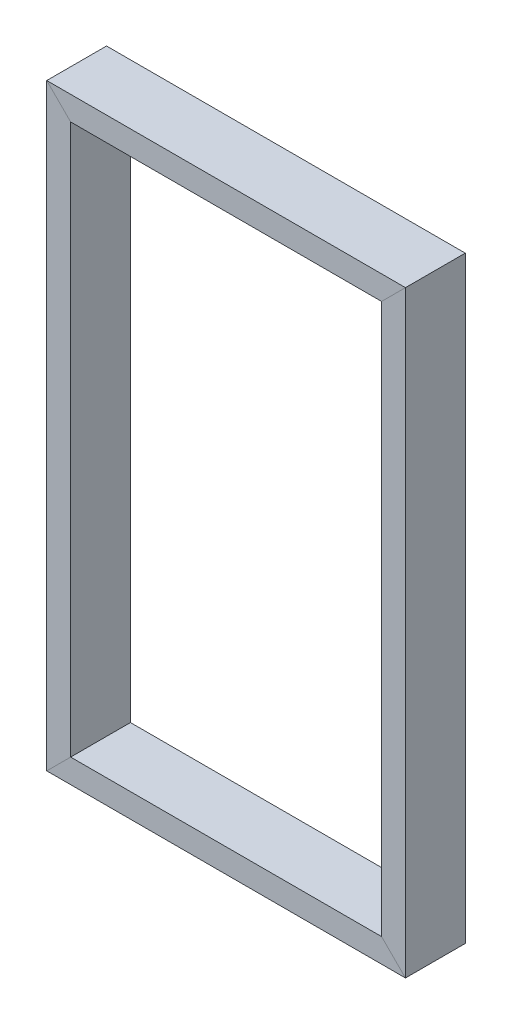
ISO-10303-21;
HEADER;
FILE_DESCRIPTION(('STEP AP214'),'2;1');
FILE_NAME('part.step','',(''),(''),'','','');
FILE_SCHEMA(('AUTOMOTIVE_DESIGN { 1 0 10303 214 1 1 1 1 }'));
ENDSEC;
DATA;
#1=APPLICATION_CONTEXT('core data for automotive mechanical design processes');
#2=APPLICATION_PROTOCOL_DEFINITION('international standard','automotive_design',2000,#1);
#3=PRODUCT_CONTEXT('',#1,'mechanical');
#4=PRODUCT('Part','Part','',(#3));
#5=PRODUCT_RELATED_PRODUCT_CATEGORY('part','',(#4));
#6=PRODUCT_DEFINITION_FORMATION('','',#4);
#7=PRODUCT_DEFINITION_CONTEXT('part definition',#1,'design');
#8=PRODUCT_DEFINITION('design','',#6,#7);
#9=PRODUCT_DEFINITION_SHAPE('','',#8);
#10=(LENGTH_UNIT() NAMED_UNIT(*) SI_UNIT(.MILLI.,.METRE.));
#11=(NAMED_UNIT(*) PLANE_ANGLE_UNIT() SI_UNIT($,.RADIAN.));
#12=(NAMED_UNIT(*) SI_UNIT($,.STERADIAN.) SOLID_ANGLE_UNIT());
#13=UNCERTAINTY_MEASURE_WITH_UNIT(LENGTH_MEASURE(1.E-05),#10,'distance_accuracy_value','');
#14=(GEOMETRIC_REPRESENTATION_CONTEXT(3) GLOBAL_UNCERTAINTY_ASSIGNED_CONTEXT((#13)) GLOBAL_UNIT_ASSIGNED_CONTEXT((#10,
#11,#12)) REPRESENTATION_CONTEXT('',''));
#15=CARTESIAN_POINT('',(0.,0.,0.));
#16=DIRECTION('',(0.,0.,1.));
#17=DIRECTION('',(1.,0.,0.));
#18=AXIS2_PLACEMENT_3D('',#15,#16,#17);
#19=CARTESIAN_POINT('',(150.000000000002,-249.999999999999,25.));
#20=DIRECTION('',(-1.,0.,0.));
#21=DIRECTION('',(0.,-1.,0.));
#22=AXIS2_PLACEMENT_3D('',#19,#20,#21);
#23=PLANE('',#22);
#24=DIRECTION('',(0.,1.,0.));
#25=VECTOR('',#24,1.);
#26=CARTESIAN_POINT('',(150.000000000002,-249.999999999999,-25.));
#27=LINE('',#26,#25);
#28=CARTESIAN_POINT('',(150.000000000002,-249.999999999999,-25.));
#29=VERTEX_POINT('',#28);
#30=CARTESIAN_POINT('',(149.999999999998,250.000000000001,-25.));
#31=VERTEX_POINT('',#30);
#32=EDGE_CURVE('E88',#29,#31,#27,.T.);
#33=ORIENTED_EDGE('',*,*,#32,.T.);
#34=DIRECTION('',(0.,0.,-1.));
#35=VECTOR('',#34,1.);
#36=CARTESIAN_POINT('',(149.999999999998,250.000000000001,25.));
#37=LINE('',#36,#35);
#38=CARTESIAN_POINT('',(149.999999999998,250.000000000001,25.));
#39=VERTEX_POINT('',#38);
#40=EDGE_CURVE('E12',#39,#31,#37,.T.);
#41=ORIENTED_EDGE('',*,*,#40,.F.);
#42=DIRECTION('',(0.,1.,0.));
#43=VECTOR('',#42,1.);
#44=CARTESIAN_POINT('',(150.000000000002,-249.999999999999,25.));
#45=LINE('',#44,#43);
#46=CARTESIAN_POINT('',(150.000000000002,-249.999999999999,25.));
#47=VERTEX_POINT('',#46);
#48=EDGE_CURVE('E106',#47,#39,#45,.T.);
#49=ORIENTED_EDGE('',*,*,#48,.F.);
#50=DIRECTION('',(0.,0.,-1.));
#51=VECTOR('',#50,1.);
#52=CARTESIAN_POINT('',(150.000000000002,-249.999999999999,25.));
#53=LINE('',#52,#51);
#54=EDGE_CURVE('E100',#47,#29,#53,.T.);
#55=ORIENTED_EDGE('',*,*,#54,.T.);
#56=EDGE_LOOP('',(#33,#41,#49,#55));
#57=FACE_BOUND('',#56,.T.);
#58=ADVANCED_FACE('F44',(#57),#23,.F.);
#59=CARTESIAN_POINT('',(149.999999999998,250.000000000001,25.));
#60=DIRECTION('',(0.707106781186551,-0.707106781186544,0.));
#61=DIRECTION('',(0.707106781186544,0.707106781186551,0.));
#62=AXIS2_PLACEMENT_3D('',#59,#60,#61);
#63=PLANE('',#62);
#64=DIRECTION('',(-0.707106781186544,-0.707106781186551,0.));
#65=VECTOR('',#64,1.);
#66=CARTESIAN_POINT('',(149.999999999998,250.000000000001,-25.));
#67=LINE('',#66,#65);
#68=CARTESIAN_POINT('',(129.999999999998,230.000000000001,-25.));
#69=VERTEX_POINT('',#68);
#70=EDGE_CURVE('E84',#31,#69,#67,.T.);
#71=ORIENTED_EDGE('',*,*,#70,.T.);
#72=DIRECTION('',(0.,0.,-1.));
#73=VECTOR('',#72,1.);
#74=CARTESIAN_POINT('',(129.999999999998,230.000000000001,25.));
#75=LINE('',#74,#73);
#76=CARTESIAN_POINT('',(129.999999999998,230.000000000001,25.));
#77=VERTEX_POINT('',#76);
#78=EDGE_CURVE('E51',#77,#69,#75,.T.);
#79=ORIENTED_EDGE('',*,*,#78,.F.);
#80=DIRECTION('',(-0.707106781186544,-0.707106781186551,0.));
#81=VECTOR('',#80,1.);
#82=CARTESIAN_POINT('',(149.999999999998,250.000000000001,25.));
#83=LINE('',#82,#81);
#84=EDGE_CURVE('E96',#39,#77,#83,.T.);
#85=ORIENTED_EDGE('',*,*,#84,.F.);
#86=ORIENTED_EDGE('',*,*,#40,.T.);
#87=EDGE_LOOP('',(#71,#79,#85,#86));
#88=FACE_BOUND('',#87,.T.);
#89=ADVANCED_FACE('F95',(#88),#63,.F.);
#90=CARTESIAN_POINT('',(130.000000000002,-229.999999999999,25.));
#91=DIRECTION('',(1.,0.,0.));
#92=DIRECTION('',(0.,1.,0.));
#93=AXIS2_PLACEMENT_3D('',#90,#91,#92);
#94=PLANE('',#93);
#95=DIRECTION('',(0.,-1.,0.));
#96=VECTOR('',#95,1.);
#97=CARTESIAN_POINT('',(130.000000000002,-229.999999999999,-25.));
#98=LINE('',#97,#96);
#99=CARTESIAN_POINT('',(130.000000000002,-229.999999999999,-25.));
#100=VERTEX_POINT('',#99);
#101=EDGE_CURVE('E89',#69,#100,#98,.T.);
#102=ORIENTED_EDGE('',*,*,#101,.T.);
#103=DIRECTION('',(0.,0.,-1.));
#104=VECTOR('',#103,1.);
#105=CARTESIAN_POINT('',(130.000000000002,-229.999999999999,25.));
#106=LINE('',#105,#104);
#107=CARTESIAN_POINT('',(130.000000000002,-229.999999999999,25.));
#108=VERTEX_POINT('',#107);
#109=EDGE_CURVE('E112',#108,#100,#106,.T.);
#110=ORIENTED_EDGE('',*,*,#109,.F.);
#111=DIRECTION('',(0.,-1.,0.));
#112=VECTOR('',#111,1.);
#113=CARTESIAN_POINT('',(130.000000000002,-229.999999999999,25.));
#114=LINE('',#113,#112);
#115=EDGE_CURVE('E63',#77,#108,#114,.T.);
#116=ORIENTED_EDGE('',*,*,#115,.F.);
#117=ORIENTED_EDGE('',*,*,#78,.T.);
#118=EDGE_LOOP('',(#102,#110,#116,#117));
#119=FACE_BOUND('',#118,.T.);
#120=ADVANCED_FACE('F115',(#119),#94,.F.);
#121=CARTESIAN_POINT('',(150.000000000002,-249.999999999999,25.));
#122=DIRECTION('',(0.707106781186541,0.707106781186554,0.));
#123=DIRECTION('',(-0.707106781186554,0.707106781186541,0.));
#124=AXIS2_PLACEMENT_3D('',#121,#122,#123);
#125=PLANE('',#124);
#126=DIRECTION('',(0.707106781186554,-0.707106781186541,0.));
#127=VECTOR('',#126,1.);
#128=CARTESIAN_POINT('',(150.000000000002,-249.999999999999,-25.));
#129=LINE('',#128,#127);
#130=EDGE_CURVE('E104',#100,#29,#129,.T.);
#131=ORIENTED_EDGE('',*,*,#130,.T.);
#132=ORIENTED_EDGE('',*,*,#54,.F.);
#133=DIRECTION('',(0.707106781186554,-0.707106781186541,0.));
#134=VECTOR('',#133,1.);
#135=CARTESIAN_POINT('',(150.000000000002,-249.999999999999,25.));
#136=LINE('',#135,#134);
#137=EDGE_CURVE('E58',#108,#47,#136,.T.);
#138=ORIENTED_EDGE('',*,*,#137,.F.);
#139=ORIENTED_EDGE('',*,*,#109,.T.);
#140=EDGE_LOOP('',(#131,#132,#138,#139));
#141=FACE_BOUND('',#140,.T.);
#142=ADVANCED_FACE('F117',(#141),#125,.F.);
#143=CARTESIAN_POINT('',(149.999999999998,250.000000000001,25.));
#144=DIRECTION('',(0.,0.,1.));
#145=DIRECTION('',(-1.,0.,0.));
#146=AXIS2_PLACEMENT_3D('',#143,#144,#145);
#147=PLANE('',#146);
#148=ORIENTED_EDGE('',*,*,#48,.T.);
#149=ORIENTED_EDGE('',*,*,#84,.T.);
#150=ORIENTED_EDGE('',*,*,#115,.T.);
#151=ORIENTED_EDGE('',*,*,#137,.T.);
#152=EDGE_LOOP('',(#148,#149,#150,#151));
#153=FACE_BOUND('',#152,.T.);
#154=ADVANCED_FACE('F118',(#153),#147,.T.);
#155=CARTESIAN_POINT('',(149.999999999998,250.000000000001,-25.));
#156=DIRECTION('',(0.,0.,1.));
#157=DIRECTION('',(-1.,0.,0.));
#158=AXIS2_PLACEMENT_3D('',#155,#156,#157);
#159=PLANE('',#158);
#160=ORIENTED_EDGE('',*,*,#32,.F.);
#161=ORIENTED_EDGE('',*,*,#130,.F.);
#162=ORIENTED_EDGE('',*,*,#101,.F.);
#163=ORIENTED_EDGE('',*,*,#70,.F.);
#164=EDGE_LOOP('',(#160,#161,#162,#163));
#165=FACE_BOUND('',#164,.T.);
#166=ADVANCED_FACE('F85',(#165),#159,.F.);
#167=CLOSED_SHELL('',(#58,#89,#120,#142,#154,#166));
#168=MANIFOLD_SOLID_BREP('B2',#167);
#169=CARTESIAN_POINT('',(130.000000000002,-229.999999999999,25.));
#170=DIRECTION('',(0.,-1.,0.));
#171=DIRECTION('',(0.,0.,1.));
#172=AXIS2_PLACEMENT_3D('',#169,#170,#171);
#173=PLANE('',#172);
#174=DIRECTION('',(-1.,0.,0.));
#175=VECTOR('',#174,1.);
#176=CARTESIAN_POINT('',(130.000000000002,-229.999999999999,-25.));
#177=LINE('',#176,#175);
#178=CARTESIAN_POINT('',(130.000000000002,-229.999999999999,-25.));
#179=VERTEX_POINT('',#178);
#180=CARTESIAN_POINT('',(-129.999999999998,-230.000000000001,-25.));
#181=VERTEX_POINT('',#180);
#182=EDGE_CURVE('E222',#179,#181,#177,.T.);
#183=ORIENTED_EDGE('',*,*,#182,.T.);
#184=DIRECTION('',(0.,0.,-1.));
#185=VECTOR('',#184,1.);
#186=CARTESIAN_POINT('',(-129.999999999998,-230.000000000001,25.));
#187=LINE('',#186,#185);
#188=CARTESIAN_POINT('',(-129.999999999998,-230.000000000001,25.));
#189=VERTEX_POINT('',#188);
#190=EDGE_CURVE('E42',#189,#181,#187,.T.);
#191=ORIENTED_EDGE('',*,*,#190,.F.);
#192=DIRECTION('',(-1.,0.,0.));
#193=VECTOR('',#192,1.);
#194=CARTESIAN_POINT('',(130.000000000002,-229.999999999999,25.));
#195=LINE('',#194,#193);
#196=CARTESIAN_POINT('',(130.000000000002,-229.999999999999,25.));
#197=VERTEX_POINT('',#196);
#198=EDGE_CURVE('E240',#197,#189,#195,.T.);
#199=ORIENTED_EDGE('',*,*,#198,.F.);
#200=DIRECTION('',(0.,0.,-1.));
#201=VECTOR('',#200,1.);
#202=CARTESIAN_POINT('',(130.000000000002,-229.999999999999,25.));
#203=LINE('',#202,#201);
#204=EDGE_CURVE('E234',#197,#179,#203,.T.);
#205=ORIENTED_EDGE('',*,*,#204,.T.);
#206=EDGE_LOOP('',(#183,#191,#199,#205));
#207=FACE_BOUND('',#206,.T.);
#208=ADVANCED_FACE('F178',(#207),#173,.F.);
#209=CARTESIAN_POINT('',(-129.999999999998,-230.000000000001,25.));
#210=DIRECTION('',(0.707106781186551,-0.707106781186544,0.));
#211=DIRECTION('',(0.707106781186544,0.707106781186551,0.));
#212=AXIS2_PLACEMENT_3D('',#209,#210,#211);
#213=PLANE('',#212);
#214=DIRECTION('',(-0.707106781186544,-0.707106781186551,0.));
#215=VECTOR('',#214,1.);
#216=CARTESIAN_POINT('',(-129.999999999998,-230.000000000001,-25.));
#217=LINE('',#216,#215);
#218=CARTESIAN_POINT('',(-149.999999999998,-250.000000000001,-25.));
#219=VERTEX_POINT('',#218);
#220=EDGE_CURVE('E218',#181,#219,#217,.T.);
#221=ORIENTED_EDGE('',*,*,#220,.T.);
#222=DIRECTION('',(0.,0.,-1.));
#223=VECTOR('',#222,1.);
#224=CARTESIAN_POINT('',(-149.999999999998,-250.000000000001,25.));
#225=LINE('',#224,#223);
#226=CARTESIAN_POINT('',(-149.999999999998,-250.000000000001,25.));
#227=VERTEX_POINT('',#226);
#228=EDGE_CURVE('E185',#227,#219,#225,.T.);
#229=ORIENTED_EDGE('',*,*,#228,.F.);
#230=DIRECTION('',(-0.707106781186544,-0.707106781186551,0.));
#231=VECTOR('',#230,1.);
#232=CARTESIAN_POINT('',(-129.999999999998,-230.000000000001,25.));
#233=LINE('',#232,#231);
#234=EDGE_CURVE('E230',#189,#227,#233,.T.);
#235=ORIENTED_EDGE('',*,*,#234,.F.);
#236=ORIENTED_EDGE('',*,*,#190,.T.);
#237=EDGE_LOOP('',(#221,#229,#235,#236));
#238=FACE_BOUND('',#237,.T.);
#239=ADVANCED_FACE('F229',(#238),#213,.F.);
#240=CARTESIAN_POINT('',(150.000000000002,-249.999999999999,25.));
#241=DIRECTION('',(0.,1.,0.));
#242=DIRECTION('',(0.,0.,-1.));
#243=AXIS2_PLACEMENT_3D('',#240,#241,#242);
#244=PLANE('',#243);
#245=DIRECTION('',(1.,0.,0.));
#246=VECTOR('',#245,1.);
#247=CARTESIAN_POINT('',(150.000000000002,-249.999999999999,-25.));
#248=LINE('',#247,#246);
#249=CARTESIAN_POINT('',(150.000000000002,-249.999999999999,-25.));
#250=VERTEX_POINT('',#249);
#251=EDGE_CURVE('E223',#219,#250,#248,.T.);
#252=ORIENTED_EDGE('',*,*,#251,.T.);
#253=DIRECTION('',(0.,0.,-1.));
#254=VECTOR('',#253,1.);
#255=CARTESIAN_POINT('',(150.000000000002,-249.999999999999,25.));
#256=LINE('',#255,#254);
#257=CARTESIAN_POINT('',(150.000000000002,-249.999999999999,25.));
#258=VERTEX_POINT('',#257);
#259=EDGE_CURVE('E246',#258,#250,#256,.T.);
#260=ORIENTED_EDGE('',*,*,#259,.F.);
#261=DIRECTION('',(1.,0.,0.));
#262=VECTOR('',#261,1.);
#263=CARTESIAN_POINT('',(150.000000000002,-249.999999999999,25.));
#264=LINE('',#263,#262);
#265=EDGE_CURVE('E197',#227,#258,#264,.T.);
#266=ORIENTED_EDGE('',*,*,#265,.F.);
#267=ORIENTED_EDGE('',*,*,#228,.T.);
#268=EDGE_LOOP('',(#252,#260,#266,#267));
#269=FACE_BOUND('',#268,.T.);
#270=ADVANCED_FACE('F249',(#269),#244,.F.);
#271=CARTESIAN_POINT('',(130.000000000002,-229.999999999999,25.));
#272=DIRECTION('',(-0.707106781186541,-0.707106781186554,0.));
#273=DIRECTION('',(0.707106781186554,-0.707106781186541,0.));
#274=AXIS2_PLACEMENT_3D('',#271,#272,#273);
#275=PLANE('',#274);
#276=DIRECTION('',(-0.707106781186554,0.707106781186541,0.));
#277=VECTOR('',#276,1.);
#278=CARTESIAN_POINT('',(130.000000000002,-229.999999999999,-25.));
#279=LINE('',#278,#277);
#280=EDGE_CURVE('E238',#250,#179,#279,.T.);
#281=ORIENTED_EDGE('',*,*,#280,.T.);
#282=ORIENTED_EDGE('',*,*,#204,.F.);
#283=DIRECTION('',(-0.707106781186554,0.707106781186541,0.));
#284=VECTOR('',#283,1.);
#285=CARTESIAN_POINT('',(130.000000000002,-229.999999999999,25.));
#286=LINE('',#285,#284);
#287=EDGE_CURVE('E192',#258,#197,#286,.T.);
#288=ORIENTED_EDGE('',*,*,#287,.F.);
#289=ORIENTED_EDGE('',*,*,#259,.T.);
#290=EDGE_LOOP('',(#281,#282,#288,#289));
#291=FACE_BOUND('',#290,.T.);
#292=ADVANCED_FACE('F251',(#291),#275,.F.);
#293=CARTESIAN_POINT('',(-129.999999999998,-230.000000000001,25.));
#294=DIRECTION('',(0.,0.,1.));
#295=DIRECTION('',(-1.,0.,0.));
#296=AXIS2_PLACEMENT_3D('',#293,#294,#295);
#297=PLANE('',#296);
#298=ORIENTED_EDGE('',*,*,#198,.T.);
#299=ORIENTED_EDGE('',*,*,#234,.T.);
#300=ORIENTED_EDGE('',*,*,#265,.T.);
#301=ORIENTED_EDGE('',*,*,#287,.T.);
#302=EDGE_LOOP('',(#298,#299,#300,#301));
#303=FACE_BOUND('',#302,.T.);
#304=ADVANCED_FACE('F252',(#303),#297,.T.);
#305=CARTESIAN_POINT('',(-129.999999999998,-230.000000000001,-25.));
#306=DIRECTION('',(0.,0.,1.));
#307=DIRECTION('',(-1.,0.,0.));
#308=AXIS2_PLACEMENT_3D('',#305,#306,#307);
#309=PLANE('',#308);
#310=ORIENTED_EDGE('',*,*,#182,.F.);
#311=ORIENTED_EDGE('',*,*,#280,.F.);
#312=ORIENTED_EDGE('',*,*,#251,.F.);
#313=ORIENTED_EDGE('',*,*,#220,.F.);
#314=EDGE_LOOP('',(#310,#311,#312,#313));
#315=FACE_BOUND('',#314,.T.);
#316=ADVANCED_FACE('F219',(#315),#309,.F.);
#317=CLOSED_SHELL('',(#208,#239,#270,#292,#304,#316));
#318=MANIFOLD_SOLID_BREP('B6',#317);
#319=CARTESIAN_POINT('',(-130.,230.,25.));
#320=DIRECTION('',(0.,1.,0.));
#321=DIRECTION('',(0.,0.,1.));
#322=AXIS2_PLACEMENT_3D('',#319,#320,#321);
#323=PLANE('',#322);
#324=DIRECTION('',(1.,0.,0.));
#325=VECTOR('',#324,1.);
#326=CARTESIAN_POINT('',(-130.,230.,-25.));
#327=LINE('',#326,#325);
#328=CARTESIAN_POINT('',(-130.,230.,-25.));
#329=VERTEX_POINT('',#328);
#330=CARTESIAN_POINT('',(130.,230.,-25.));
#331=VERTEX_POINT('',#330);
#332=EDGE_CURVE('E355',#329,#331,#327,.T.);
#333=ORIENTED_EDGE('',*,*,#332,.T.);
#334=DIRECTION('',(0.,0.,-1.));
#335=VECTOR('',#334,1.);
#336=CARTESIAN_POINT('',(130.,230.,25.));
#337=LINE('',#336,#335);
#338=CARTESIAN_POINT('',(130.,230.,25.));
#339=VERTEX_POINT('',#338);
#340=EDGE_CURVE('E176',#339,#331,#337,.T.);
#341=ORIENTED_EDGE('',*,*,#340,.F.);
#342=DIRECTION('',(1.,0.,0.));
#343=VECTOR('',#342,1.);
#344=CARTESIAN_POINT('',(-130.,230.,25.));
#345=LINE('',#344,#343);
#346=CARTESIAN_POINT('',(-130.,230.,25.));
#347=VERTEX_POINT('',#346);
#348=EDGE_CURVE('E373',#347,#339,#345,.T.);
#349=ORIENTED_EDGE('',*,*,#348,.F.);
#350=DIRECTION('',(0.,0.,-1.));
#351=VECTOR('',#350,1.);
#352=CARTESIAN_POINT('',(-130.,230.,25.));
#353=LINE('',#352,#351);
#354=EDGE_CURVE('E367',#347,#329,#353,.T.);
#355=ORIENTED_EDGE('',*,*,#354,.T.);
#356=EDGE_LOOP('',(#333,#341,#349,#355));
#357=FACE_BOUND('',#356,.T.);
#358=ADVANCED_FACE('F311',(#357),#323,.F.);
#359=CARTESIAN_POINT('',(130.,230.,25.));
#360=DIRECTION('',(-0.707106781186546,0.707106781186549,0.));
#361=DIRECTION('',(-0.707106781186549,-0.707106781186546,0.));
#362=AXIS2_PLACEMENT_3D('',#359,#360,#361);
#363=PLANE('',#362);
#364=DIRECTION('',(0.707106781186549,0.707106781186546,0.));
#365=VECTOR('',#364,1.);
#366=CARTESIAN_POINT('',(130.,230.,-25.));
#367=LINE('',#366,#365);
#368=CARTESIAN_POINT('',(150.,250.,-25.));
#369=VERTEX_POINT('',#368);
#370=EDGE_CURVE('E351',#331,#369,#367,.T.);
#371=ORIENTED_EDGE('',*,*,#370,.T.);
#372=DIRECTION('',(0.,0.,-1.));
#373=VECTOR('',#372,1.);
#374=CARTESIAN_POINT('',(150.,250.,25.));
#375=LINE('',#374,#373);
#376=CARTESIAN_POINT('',(150.,250.,25.));
#377=VERTEX_POINT('',#376);
#378=EDGE_CURVE('E318',#377,#369,#375,.T.);
#379=ORIENTED_EDGE('',*,*,#378,.F.);
#380=DIRECTION('',(0.707106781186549,0.707106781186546,0.));
#381=VECTOR('',#380,1.);
#382=CARTESIAN_POINT('',(130.,230.,25.));
#383=LINE('',#382,#381);
#384=EDGE_CURVE('E363',#339,#377,#383,.T.);
#385=ORIENTED_EDGE('',*,*,#384,.F.);
#386=ORIENTED_EDGE('',*,*,#340,.T.);
#387=EDGE_LOOP('',(#371,#379,#385,#386));
#388=FACE_BOUND('',#387,.T.);
#389=ADVANCED_FACE('F362',(#388),#363,.F.);
#390=CARTESIAN_POINT('',(-150.,250.,25.));
#391=DIRECTION('',(0.,-1.,0.));
#392=DIRECTION('',(0.,0.,-1.));
#393=AXIS2_PLACEMENT_3D('',#390,#391,#392);
#394=PLANE('',#393);
#395=DIRECTION('',(-1.,0.,0.));
#396=VECTOR('',#395,1.);
#397=CARTESIAN_POINT('',(-150.,250.,-25.));
#398=LINE('',#397,#396);
#399=CARTESIAN_POINT('',(-150.,250.,-25.));
#400=VERTEX_POINT('',#399);
#401=EDGE_CURVE('E356',#369,#400,#398,.T.);
#402=ORIENTED_EDGE('',*,*,#401,.T.);
#403=DIRECTION('',(0.,0.,-1.));
#404=VECTOR('',#403,1.);
#405=CARTESIAN_POINT('',(-150.,250.,25.));
#406=LINE('',#405,#404);
#407=CARTESIAN_POINT('',(-150.,250.,25.));
#408=VERTEX_POINT('',#407);
#409=EDGE_CURVE('E379',#408,#400,#406,.T.);
#410=ORIENTED_EDGE('',*,*,#409,.F.);
#411=DIRECTION('',(-1.,0.,0.));
#412=VECTOR('',#411,1.);
#413=CARTESIAN_POINT('',(-150.,250.,25.));
#414=LINE('',#413,#412);
#415=EDGE_CURVE('E330',#377,#408,#414,.T.);
#416=ORIENTED_EDGE('',*,*,#415,.F.);
#417=ORIENTED_EDGE('',*,*,#378,.T.);
#418=EDGE_LOOP('',(#402,#410,#416,#417));
#419=FACE_BOUND('',#418,.T.);
#420=ADVANCED_FACE('F382',(#419),#394,.F.);
#421=CARTESIAN_POINT('',(-130.,230.,25.));
#422=DIRECTION('',(0.707106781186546,0.707106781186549,0.));
#423=DIRECTION('',(-0.707106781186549,0.707106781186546,0.));
#424=AXIS2_PLACEMENT_3D('',#421,#422,#423);
#425=PLANE('',#424);
#426=DIRECTION('',(0.707106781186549,-0.707106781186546,0.));
#427=VECTOR('',#426,1.);
#428=CARTESIAN_POINT('',(-130.,230.,-25.));
#429=LINE('',#428,#427);
#430=EDGE_CURVE('E371',#400,#329,#429,.T.);
#431=ORIENTED_EDGE('',*,*,#430,.T.);
#432=ORIENTED_EDGE('',*,*,#354,.F.);
#433=DIRECTION('',(0.707106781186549,-0.707106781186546,0.));
#434=VECTOR('',#433,1.);
#435=CARTESIAN_POINT('',(-130.,230.,25.));
#436=LINE('',#435,#434);
#437=EDGE_CURVE('E325',#408,#347,#436,.T.);
#438=ORIENTED_EDGE('',*,*,#437,.F.);
#439=ORIENTED_EDGE('',*,*,#409,.T.);
#440=EDGE_LOOP('',(#431,#432,#438,#439));
#441=FACE_BOUND('',#440,.T.);
#442=ADVANCED_FACE('F384',(#441),#425,.F.);
#443=CARTESIAN_POINT('',(130.,230.,25.));
#444=DIRECTION('',(0.,0.,1.));
#445=DIRECTION('',(1.,0.,0.));
#446=AXIS2_PLACEMENT_3D('',#443,#444,#445);
#447=PLANE('',#446);
#448=ORIENTED_EDGE('',*,*,#348,.T.);
#449=ORIENTED_EDGE('',*,*,#384,.T.);
#450=ORIENTED_EDGE('',*,*,#415,.T.);
#451=ORIENTED_EDGE('',*,*,#437,.T.);
#452=EDGE_LOOP('',(#448,#449,#450,#451));
#453=FACE_BOUND('',#452,.T.);
#454=ADVANCED_FACE('F385',(#453),#447,.T.);
#455=CARTESIAN_POINT('',(130.,230.,-25.));
#456=DIRECTION('',(0.,0.,1.));
#457=DIRECTION('',(1.,0.,0.));
#458=AXIS2_PLACEMENT_3D('',#455,#456,#457);
#459=PLANE('',#458);
#460=ORIENTED_EDGE('',*,*,#332,.F.);
#461=ORIENTED_EDGE('',*,*,#430,.F.);
#462=ORIENTED_EDGE('',*,*,#401,.F.);
#463=ORIENTED_EDGE('',*,*,#370,.F.);
#464=EDGE_LOOP('',(#460,#461,#462,#463));
#465=FACE_BOUND('',#464,.T.);
#466=ADVANCED_FACE('F352',(#465),#459,.F.);
#467=CLOSED_SHELL('',(#358,#389,#420,#442,#454,#466));
#468=MANIFOLD_SOLID_BREP('B36',#467);
#469=CARTESIAN_POINT('',(-150.,250.,25.));
#470=DIRECTION('',(1.,0.,0.));
#471=DIRECTION('',(0.,1.,0.));
#472=AXIS2_PLACEMENT_3D('',#469,#470,#471);
#473=PLANE('',#472);
#474=DIRECTION('',(0.,-1.,0.));
#475=VECTOR('',#474,1.);
#476=CARTESIAN_POINT('',(-150.,250.,-25.));
#477=LINE('',#476,#475);
#478=CARTESIAN_POINT('',(-150.,250.,-25.));
#479=VERTEX_POINT('',#478);
#480=CARTESIAN_POINT('',(-150.,-250.,-25.));
#481=VERTEX_POINT('',#480);
#482=EDGE_CURVE('E479',#479,#481,#477,.T.);
#483=ORIENTED_EDGE('',*,*,#482,.T.);
#484=DIRECTION('',(0.,0.,-1.));
#485=VECTOR('',#484,1.);
#486=CARTESIAN_POINT('',(-150.,-250.,25.));
#487=LINE('',#486,#485);
#488=CARTESIAN_POINT('',(-150.,-250.,25.));
#489=VERTEX_POINT('',#488);
#490=EDGE_CURVE('E309',#489,#481,#487,.T.);
#491=ORIENTED_EDGE('',*,*,#490,.F.);
#492=DIRECTION('',(0.,-1.,0.));
#493=VECTOR('',#492,1.);
#494=CARTESIAN_POINT('',(-150.,250.,25.));
#495=LINE('',#494,#493);
#496=CARTESIAN_POINT('',(-150.,250.,25.));
#497=VERTEX_POINT('',#496);
#498=EDGE_CURVE('E497',#497,#489,#495,.T.);
#499=ORIENTED_EDGE('',*,*,#498,.F.);
#500=DIRECTION('',(0.,0.,-1.));
#501=VECTOR('',#500,1.);
#502=CARTESIAN_POINT('',(-150.,250.,25.));
#503=LINE('',#502,#501);
#504=EDGE_CURVE('E491',#497,#479,#503,.T.);
#505=ORIENTED_EDGE('',*,*,#504,.T.);
#506=EDGE_LOOP('',(#483,#491,#499,#505));
#507=FACE_BOUND('',#506,.T.);
#508=ADVANCED_FACE('F435',(#507),#473,.F.);
#509=CARTESIAN_POINT('',(-150.,-250.,25.));
#510=DIRECTION('',(-0.707106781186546,0.707106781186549,0.));
#511=DIRECTION('',(-0.707106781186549,-0.707106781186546,0.));
#512=AXIS2_PLACEMENT_3D('',#509,#510,#511);
#513=PLANE('',#512);
#514=DIRECTION('',(0.707106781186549,0.707106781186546,0.));
#515=VECTOR('',#514,1.);
#516=CARTESIAN_POINT('',(-150.,-250.,-25.));
#517=LINE('',#516,#515);
#518=CARTESIAN_POINT('',(-130.,-230.,-25.));
#519=VERTEX_POINT('',#518);
#520=EDGE_CURVE('E475',#481,#519,#517,.T.);
#521=ORIENTED_EDGE('',*,*,#520,.T.);
#522=DIRECTION('',(0.,0.,-1.));
#523=VECTOR('',#522,1.);
#524=CARTESIAN_POINT('',(-130.,-230.,25.));
#525=LINE('',#524,#523);
#526=CARTESIAN_POINT('',(-130.,-230.,25.));
#527=VERTEX_POINT('',#526);
#528=EDGE_CURVE('E442',#527,#519,#525,.T.);
#529=ORIENTED_EDGE('',*,*,#528,.F.);
#530=DIRECTION('',(0.707106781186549,0.707106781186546,0.));
#531=VECTOR('',#530,1.);
#532=CARTESIAN_POINT('',(-150.,-250.,25.));
#533=LINE('',#532,#531);
#534=EDGE_CURVE('E487',#489,#527,#533,.T.);
#535=ORIENTED_EDGE('',*,*,#534,.F.);
#536=ORIENTED_EDGE('',*,*,#490,.T.);
#537=EDGE_LOOP('',(#521,#529,#535,#536));
#538=FACE_BOUND('',#537,.T.);
#539=ADVANCED_FACE('F486',(#538),#513,.F.);
#540=CARTESIAN_POINT('',(-130.,230.,25.));
#541=DIRECTION('',(-1.,0.,0.));
#542=DIRECTION('',(0.,-1.,0.));
#543=AXIS2_PLACEMENT_3D('',#540,#541,#542);
#544=PLANE('',#543);
#545=DIRECTION('',(0.,1.,0.));
#546=VECTOR('',#545,1.);
#547=CARTESIAN_POINT('',(-130.,230.,-25.));
#548=LINE('',#547,#546);
#549=CARTESIAN_POINT('',(-130.,230.,-25.));
#550=VERTEX_POINT('',#549);
#551=EDGE_CURVE('E480',#519,#550,#548,.T.);
#552=ORIENTED_EDGE('',*,*,#551,.T.);
#553=DIRECTION('',(0.,0.,-1.));
#554=VECTOR('',#553,1.);
#555=CARTESIAN_POINT('',(-130.,230.,25.));
#556=LINE('',#555,#554);
#557=CARTESIAN_POINT('',(-130.,230.,25.));
#558=VERTEX_POINT('',#557);
#559=EDGE_CURVE('E503',#558,#550,#556,.T.);
#560=ORIENTED_EDGE('',*,*,#559,.F.);
#561=DIRECTION('',(0.,1.,0.));
#562=VECTOR('',#561,1.);
#563=CARTESIAN_POINT('',(-130.,230.,25.));
#564=LINE('',#563,#562);
#565=EDGE_CURVE('E454',#527,#558,#564,.T.);
#566=ORIENTED_EDGE('',*,*,#565,.F.);
#567=ORIENTED_EDGE('',*,*,#528,.T.);
#568=EDGE_LOOP('',(#552,#560,#566,#567));
#569=FACE_BOUND('',#568,.T.);
#570=ADVANCED_FACE('F506',(#569),#544,.F.);
#571=CARTESIAN_POINT('',(-150.,250.,25.));
#572=DIRECTION('',(-0.707106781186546,-0.707106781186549,0.));
#573=DIRECTION('',(0.707106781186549,-0.707106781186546,0.));
#574=AXIS2_PLACEMENT_3D('',#571,#572,#573);
#575=PLANE('',#574);
#576=DIRECTION('',(-0.707106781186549,0.707106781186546,0.));
#577=VECTOR('',#576,1.);
#578=CARTESIAN_POINT('',(-150.,250.,-25.));
#579=LINE('',#578,#577);
#580=EDGE_CURVE('E495',#550,#479,#579,.T.);
#581=ORIENTED_EDGE('',*,*,#580,.T.);
#582=ORIENTED_EDGE('',*,*,#504,.F.);
#583=DIRECTION('',(-0.707106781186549,0.707106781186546,0.));
#584=VECTOR('',#583,1.);
#585=CARTESIAN_POINT('',(-150.,250.,25.));
#586=LINE('',#585,#584);
#587=EDGE_CURVE('E449',#558,#497,#586,.T.);
#588=ORIENTED_EDGE('',*,*,#587,.F.);
#589=ORIENTED_EDGE('',*,*,#559,.T.);
#590=EDGE_LOOP('',(#581,#582,#588,#589));
#591=FACE_BOUND('',#590,.T.);
#592=ADVANCED_FACE('F508',(#591),#575,.F.);
#593=CARTESIAN_POINT('',(-150.,-250.,25.));
#594=DIRECTION('',(0.,0.,1.));
#595=DIRECTION('',(1.,0.,0.));
#596=AXIS2_PLACEMENT_3D('',#593,#594,#595);
#597=PLANE('',#596);
#598=ORIENTED_EDGE('',*,*,#498,.T.);
#599=ORIENTED_EDGE('',*,*,#534,.T.);
#600=ORIENTED_EDGE('',*,*,#565,.T.);
#601=ORIENTED_EDGE('',*,*,#587,.T.);
#602=EDGE_LOOP('',(#598,#599,#600,#601));
#603=FACE_BOUND('',#602,.T.);
#604=ADVANCED_FACE('F509',(#603),#597,.T.);
#605=CARTESIAN_POINT('',(-150.,-250.,-25.));
#606=DIRECTION('',(0.,0.,1.));
#607=DIRECTION('',(1.,0.,0.));
#608=AXIS2_PLACEMENT_3D('',#605,#606,#607);
#609=PLANE('',#608);
#610=ORIENTED_EDGE('',*,*,#482,.F.);
#611=ORIENTED_EDGE('',*,*,#580,.F.);
#612=ORIENTED_EDGE('',*,*,#551,.F.);
#613=ORIENTED_EDGE('',*,*,#520,.F.);
#614=EDGE_LOOP('',(#610,#611,#612,#613));
#615=FACE_BOUND('',#614,.T.);
#616=ADVANCED_FACE('F476',(#615),#609,.F.);
#617=CLOSED_SHELL('',(#508,#539,#570,#592,#604,#616));
#618=MANIFOLD_SOLID_BREP('B170',#617);
#619=ADVANCED_BREP_SHAPE_REPRESENTATION('',(#18,#168,#318,#468,#618),#14);
#620=SHAPE_DEFINITION_REPRESENTATION(#9,#619);
ENDSEC;
END-ISO-10303-21;
